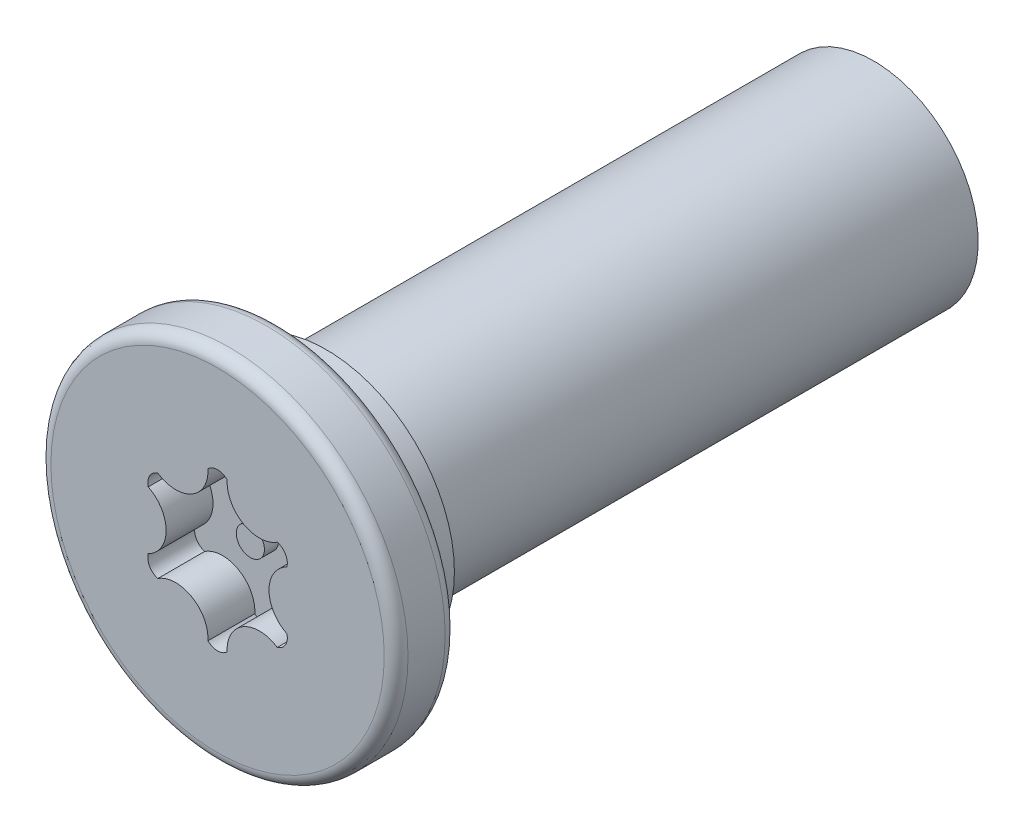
ISO-10303-21;
HEADER;
FILE_DESCRIPTION(('STEP AP214'),'2;1');
FILE_NAME('part.step','',(''),(''),'','','');
FILE_SCHEMA(('AUTOMOTIVE_DESIGN { 1 0 10303 214 1 1 1 1 }'));
ENDSEC;
DATA;
#1=APPLICATION_CONTEXT('core data for automotive mechanical design processes');
#2=APPLICATION_PROTOCOL_DEFINITION('international standard','automotive_design',2000,#1);
#3=PRODUCT_CONTEXT('',#1,'mechanical');
#4=PRODUCT('Part','Part','',(#3));
#5=PRODUCT_RELATED_PRODUCT_CATEGORY('part','',(#4));
#6=PRODUCT_DEFINITION_FORMATION('','',#4);
#7=PRODUCT_DEFINITION_CONTEXT('part definition',#1,'design');
#8=PRODUCT_DEFINITION('design','',#6,#7);
#9=PRODUCT_DEFINITION_SHAPE('','',#8);
#10=(LENGTH_UNIT() NAMED_UNIT(*) SI_UNIT(.MILLI.,.METRE.));
#11=(NAMED_UNIT(*) PLANE_ANGLE_UNIT() SI_UNIT($,.RADIAN.));
#12=(NAMED_UNIT(*) SI_UNIT($,.STERADIAN.) SOLID_ANGLE_UNIT());
#13=UNCERTAINTY_MEASURE_WITH_UNIT(LENGTH_MEASURE(1.E-05),#10,'distance_accuracy_value','');
#14=(GEOMETRIC_REPRESENTATION_CONTEXT(3) GLOBAL_UNCERTAINTY_ASSIGNED_CONTEXT((#13)) GLOBAL_UNIT_ASSIGNED_CONTEXT((#10,
#11,#12)) REPRESENTATION_CONTEXT('',''));
#15=CARTESIAN_POINT('',(0.,0.,0.));
#16=DIRECTION('',(0.,0.,1.));
#17=DIRECTION('',(1.,0.,0.));
#18=AXIS2_PLACEMENT_3D('',#15,#16,#17);
#19=CARTESIAN_POINT('',(0.,0.,0.));
#20=DIRECTION('',(0.,0.,1.));
#21=DIRECTION('',(1.,0.,0.));
#22=AXIS2_PLACEMENT_3D('',#19,#20,#21);
#23=PLANE('',#22);
#24=CARTESIAN_POINT('',(0.,0.,0.));
#25=DIRECTION('',(0.,0.,1.));
#26=DIRECTION('',(1.,0.,0.));
#27=AXIS2_PLACEMENT_3D('',#24,#25,#26);
#28=CIRCLE('',#27,3.55599999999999);
#29=CARTESIAN_POINT('',(3.55599999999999,0.,0.));
#30=VERTEX_POINT('',#29);
#31=EDGE_CURVE('E54',#30,#30,#28,.T.);
#32=ORIENTED_EDGE('',*,*,#31,.T.);
#33=EDGE_LOOP('',(#32));
#34=FACE_BOUND('',#33,.T.);
#35=CARTESIAN_POINT('',(0.893828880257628,1.54815703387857,0.));
#36=DIRECTION('',(0.,0.,1.));
#37=DIRECTION('',(1.,0.,0.));
#38=AXIS2_PLACEMENT_3D('',#35,#36,#37);
#39=CIRCLE('',#38,0.69);
#40=CARTESIAN_POINT('',(0.205060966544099,1.58937306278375,0.));
#41=VERTEX_POINT('',#40);
#42=CARTESIAN_POINT('',(1.27390696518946,0.972274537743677,0.));
#43=VERTEX_POINT('',#42);
#44=EDGE_CURVE('E181',#41,#43,#39,.T.);
#45=ORIENTED_EDGE('',*,*,#44,.T.);
#46=CARTESIAN_POINT('',(1.19884944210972,0.692156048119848,0.));
#47=DIRECTION('',(0.,0.,1.));
#48=DIRECTION('',(1.,0.,0.));
#49=AXIS2_PLACEMENT_3D('',#46,#47,#48);
#50=CIRCLE('',#49,0.29);
#51=CARTESIAN_POINT('',(1.47896793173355,0.617098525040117,0.));
#52=VERTEX_POINT('',#51);
#53=EDGE_CURVE('E61',#43,#52,#50,.F.);
#54=ORIENTED_EDGE('',*,*,#53,.T.);
#55=CARTESIAN_POINT('',(1.78765776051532,0.,0.));
#56=DIRECTION('',(0.,0.,1.));
#57=DIRECTION('',(1.,0.,0.));
#58=AXIS2_PLACEMENT_3D('',#55,#56,#57);
#59=CIRCLE('',#58,0.69);
#60=CARTESIAN_POINT('',(1.47896793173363,-0.617098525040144,0.));
#61=VERTEX_POINT('',#60);
#62=EDGE_CURVE('E111',#52,#61,#59,.T.);
#63=ORIENTED_EDGE('',*,*,#62,.T.);
#64=CARTESIAN_POINT('',(1.1988494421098,-0.692156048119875,0.));
#65=DIRECTION('',(0.,0.,1.));
#66=DIRECTION('',(1.,0.,0.));
#67=AXIS2_PLACEMENT_3D('',#64,#65,#66);
#68=CIRCLE('',#67,0.29);
#69=CARTESIAN_POINT('',(1.27390696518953,-0.972274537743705,0.));
#70=VERTEX_POINT('',#69);
#71=EDGE_CURVE('E216',#61,#70,#68,.F.);
#72=ORIENTED_EDGE('',*,*,#71,.T.);
#73=CARTESIAN_POINT('',(0.893828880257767,-1.54815703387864,0.));
#74=DIRECTION('',(0.,0.,1.));
#75=DIRECTION('',(1.,0.,0.));
#76=AXIS2_PLACEMENT_3D('',#73,#74,#75);
#77=CIRCLE('',#76,0.69);
#78=CARTESIAN_POINT('',(0.205060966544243,-1.5893730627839,0.));
#79=VERTEX_POINT('',#78);
#80=EDGE_CURVE('E160',#70,#79,#77,.T.);
#81=ORIENTED_EDGE('',*,*,#80,.T.);
#82=CARTESIAN_POINT('',(1.43067375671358E-13,-1.3843120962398,0.));
#83=DIRECTION('',(0.,0.,1.));
#84=DIRECTION('',(1.,0.,0.));
#85=AXIS2_PLACEMENT_3D('',#82,#83,#84);
#86=CIRCLE('',#85,0.29);
#87=CARTESIAN_POINT('',(-0.205060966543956,-1.5893730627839,0.));
#88=VERTEX_POINT('',#87);
#89=EDGE_CURVE('E210',#79,#88,#86,.F.);
#90=ORIENTED_EDGE('',*,*,#89,.T.);
#91=CARTESIAN_POINT('',(-0.893828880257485,-1.54815703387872,0.));
#92=DIRECTION('',(0.,0.,1.));
#93=DIRECTION('',(1.,0.,0.));
#94=AXIS2_PLACEMENT_3D('',#91,#92,#93);
#95=CIRCLE('',#94,0.69);
#96=CARTESIAN_POINT('',(-1.27390696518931,-0.97227453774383,0.));
#97=VERTEX_POINT('',#96);
#98=EDGE_CURVE('E206',#88,#97,#95,.T.);
#99=ORIENTED_EDGE('',*,*,#98,.T.);
#100=CARTESIAN_POINT('',(-1.19884944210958,-0.69215604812,0.));
#101=DIRECTION('',(0.,0.,1.));
#102=DIRECTION('',(1.,0.,0.));
#103=AXIS2_PLACEMENT_3D('',#100,#101,#102);
#104=CIRCLE('',#103,0.29);
#105=CARTESIAN_POINT('',(-1.47896793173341,-0.617098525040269,0.));
#106=VERTEX_POINT('',#105);
#107=EDGE_CURVE('E202',#97,#106,#104,.F.);
#108=ORIENTED_EDGE('',*,*,#107,.T.);
#109=CARTESIAN_POINT('',(-1.78765776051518,-1.56674837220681E-13,0.));
#110=DIRECTION('',(0.,0.,1.));
#111=DIRECTION('',(1.,0.,0.));
#112=AXIS2_PLACEMENT_3D('',#109,#110,#111);
#113=CIRCLE('',#112,0.69);
#114=CARTESIAN_POINT('',(-1.47896793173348,0.617098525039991,0.));
#115=VERTEX_POINT('',#114);
#116=EDGE_CURVE('E198',#106,#115,#113,.T.);
#117=ORIENTED_EDGE('',*,*,#116,.T.);
#118=CARTESIAN_POINT('',(-1.19884944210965,0.692156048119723,0.));
#119=DIRECTION('',(0.,0.,1.));
#120=DIRECTION('',(1.,0.,0.));
#121=AXIS2_PLACEMENT_3D('',#118,#119,#120);
#122=CIRCLE('',#121,0.29);
#123=CARTESIAN_POINT('',(-1.27390696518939,0.972274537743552,0.));
#124=VERTEX_POINT('',#123);
#125=EDGE_CURVE('E194',#115,#124,#122,.F.);
#126=ORIENTED_EDGE('',*,*,#125,.T.);
#127=CARTESIAN_POINT('',(-0.893828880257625,1.54815703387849,0.));
#128=DIRECTION('',(0.,0.,1.));
#129=DIRECTION('',(1.,0.,0.));
#130=AXIS2_PLACEMENT_3D('',#127,#128,#129);
#131=CIRCLE('',#130,0.690000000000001);
#132=CARTESIAN_POINT('',(-0.205060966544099,1.58937306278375,0.));
#133=VERTEX_POINT('',#132);
#134=EDGE_CURVE('E190',#124,#133,#131,.T.);
#135=ORIENTED_EDGE('',*,*,#134,.T.);
#136=CARTESIAN_POINT('',(0.,1.38431209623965,0.));
#137=DIRECTION('',(0.,0.,1.));
#138=DIRECTION('',(1.,0.,0.));
#139=AXIS2_PLACEMENT_3D('',#136,#137,#138);
#140=CIRCLE('',#139,0.29);
#141=EDGE_CURVE('E186',#133,#41,#140,.F.);
#142=ORIENTED_EDGE('',*,*,#141,.T.);
#143=EDGE_LOOP('',(#45,#54,#63,#72,#81,#90,#99,#108,#117,#126,#135,#142));
#144=FACE_BOUND('',#143,.T.);
#145=ADVANCED_FACE('F45',(#34,#144),#23,.T.);
#146=CARTESIAN_POINT('',(0.,0.,-1.3));
#147=DIRECTION('',(0.,0.,1.));
#148=DIRECTION('',(1.,0.,0.));
#149=AXIS2_PLACEMENT_3D('',#146,#147,#148);
#150=PLANE('',#149);
#151=CARTESIAN_POINT('',(0.,0.,-1.3));
#152=DIRECTION('',(0.,0.,1.));
#153=DIRECTION('',(1.,0.,0.));
#154=AXIS2_PLACEMENT_3D('',#151,#152,#153);
#155=CIRCLE('',#154,2.738000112);
#156=CARTESIAN_POINT('',(2.738000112,0.,-1.3));
#157=VERTEX_POINT('',#156);
#158=EDGE_CURVE('E11',#157,#157,#155,.F.);
#159=ORIENTED_EDGE('',*,*,#158,.F.);
#160=EDGE_LOOP('',(#159));
#161=FACE_BOUND('',#160,.T.);
#162=CARTESIAN_POINT('',(0.,0.,-1.3));
#163=DIRECTION('',(0.,0.,1.));
#164=DIRECTION('',(1.,0.,0.));
#165=AXIS2_PLACEMENT_3D('',#162,#163,#164);
#166=CIRCLE('',#165,3.55599999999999);
#167=CARTESIAN_POINT('',(3.55599999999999,0.,-1.3));
#168=VERTEX_POINT('',#167);
#169=EDGE_CURVE('E260',#168,#168,#166,.F.);
#170=ORIENTED_EDGE('',*,*,#169,.T.);
#171=EDGE_LOOP('',(#170));
#172=FACE_BOUND('',#171,.T.);
#173=ADVANCED_FACE('F283',(#161,#172),#150,.F.);
#174=CARTESIAN_POINT('',(0.,0.,-1.3));
#175=DIRECTION('',(0.,0.,1.));
#176=DIRECTION('',(1.,0.,0.));
#177=AXIS2_PLACEMENT_3D('',#174,#175,#176);
#178=CYLINDRICAL_SURFACE('',#177,3.80999999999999);
#179=CARTESIAN_POINT('',(0.,0.,-1.046));
#180=DIRECTION('',(0.,0.,1.));
#181=DIRECTION('',(1.,0.,0.));
#182=AXIS2_PLACEMENT_3D('',#179,#180,#181);
#183=CIRCLE('',#182,3.80999999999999);
#184=CARTESIAN_POINT('',(3.80999999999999,0.,-1.046));
#185=VERTEX_POINT('',#184);
#186=EDGE_CURVE('E256',#185,#185,#183,.T.);
#187=ORIENTED_EDGE('',*,*,#186,.T.);
#188=EDGE_LOOP('',(#187));
#189=FACE_BOUND('',#188,.T.);
#190=CARTESIAN_POINT('',(0.,0.,-0.254));
#191=DIRECTION('',(0.,0.,1.));
#192=DIRECTION('',(1.,0.,0.));
#193=AXIS2_PLACEMENT_3D('',#190,#191,#192);
#194=CIRCLE('',#193,3.80999999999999);
#195=CARTESIAN_POINT('',(3.80999999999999,0.,-0.254));
#196=VERTEX_POINT('',#195);
#197=EDGE_CURVE('E225',#196,#196,#194,.F.);
#198=ORIENTED_EDGE('',*,*,#197,.T.);
#199=EDGE_LOOP('',(#198));
#200=FACE_BOUND('',#199,.T.);
#201=ADVANCED_FACE('F289',(#189,#200),#178,.T.);
#202=CARTESIAN_POINT('',(1.19884944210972,0.692156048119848,-1.));
#203=DIRECTION('',(0.,0.,1.));
#204=DIRECTION('',(1.,0.,0.));
#205=AXIS2_PLACEMENT_3D('',#202,#203,#204);
#206=CYLINDRICAL_SURFACE('',#205,0.29);
#207=ORIENTED_EDGE('',*,*,#53,.F.);
#208=DIRECTION('',(0.,0.,1.));
#209=VECTOR('',#208,1.);
#210=CARTESIAN_POINT('',(1.27390696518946,0.972274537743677,-1.));
#211=LINE('',#210,#209);
#212=CARTESIAN_POINT('',(1.27390696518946,0.972274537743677,-1.));
#213=VERTEX_POINT('',#212);
#214=EDGE_CURVE('E178',#213,#43,#211,.T.);
#215=ORIENTED_EDGE('',*,*,#214,.F.);
#216=CARTESIAN_POINT('',(1.19884944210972,0.692156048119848,-1.));
#217=DIRECTION('',(0.,0.,1.));
#218=DIRECTION('',(1.,0.,0.));
#219=AXIS2_PLACEMENT_3D('',#216,#217,#218);
#220=CIRCLE('',#219,0.29);
#221=CARTESIAN_POINT('',(1.47896793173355,0.617098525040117,-1.));
#222=VERTEX_POINT('',#221);
#223=EDGE_CURVE('E221',#213,#222,#220,.F.);
#224=ORIENTED_EDGE('',*,*,#223,.T.);
#225=DIRECTION('',(0.,0.,1.));
#226=VECTOR('',#225,1.);
#227=CARTESIAN_POINT('',(1.47896793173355,0.617098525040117,-1.));
#228=LINE('',#227,#226);
#229=EDGE_CURVE('E222',#222,#52,#228,.T.);
#230=ORIENTED_EDGE('',*,*,#229,.T.);
#231=EDGE_LOOP('',(#207,#215,#224,#230));
#232=FACE_BOUND('',#231,.T.);
#233=ADVANCED_FACE('F294',(#232),#206,.F.);
#234=CARTESIAN_POINT('',(1.78765776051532,0.,-1.));
#235=DIRECTION('',(0.,0.,1.));
#236=DIRECTION('',(1.,0.,0.));
#237=AXIS2_PLACEMENT_3D('',#234,#235,#236);
#238=CYLINDRICAL_SURFACE('',#237,0.69);
#239=ORIENTED_EDGE('',*,*,#62,.F.);
#240=ORIENTED_EDGE('',*,*,#229,.F.);
#241=CARTESIAN_POINT('',(1.78765776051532,0.,-1.));
#242=DIRECTION('',(0.,0.,1.));
#243=DIRECTION('',(1.,0.,0.));
#244=AXIS2_PLACEMENT_3D('',#241,#242,#243);
#245=CIRCLE('',#244,0.69);
#246=CARTESIAN_POINT('',(1.47896793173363,-0.617098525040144,-1.));
#247=VERTEX_POINT('',#246);
#248=EDGE_CURVE('E70',#222,#247,#245,.T.);
#249=ORIENTED_EDGE('',*,*,#248,.T.);
#250=DIRECTION('',(0.,0.,1.));
#251=VECTOR('',#250,1.);
#252=CARTESIAN_POINT('',(1.47896793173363,-0.617098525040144,-1.));
#253=LINE('',#252,#251);
#254=EDGE_CURVE('E151',#247,#61,#253,.T.);
#255=ORIENTED_EDGE('',*,*,#254,.T.);
#256=EDGE_LOOP('',(#239,#240,#249,#255));
#257=FACE_BOUND('',#256,.T.);
#258=ADVANCED_FACE('F301',(#257),#238,.T.);
#259=CARTESIAN_POINT('',(1.1988494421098,-0.692156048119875,-1.));
#260=DIRECTION('',(0.,0.,1.));
#261=DIRECTION('',(1.,0.,0.));
#262=AXIS2_PLACEMENT_3D('',#259,#260,#261);
#263=CYLINDRICAL_SURFACE('',#262,0.29);
#264=ORIENTED_EDGE('',*,*,#71,.F.);
#265=ORIENTED_EDGE('',*,*,#254,.F.);
#266=CARTESIAN_POINT('',(1.1988494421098,-0.692156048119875,-1.));
#267=DIRECTION('',(0.,0.,1.));
#268=DIRECTION('',(1.,0.,0.));
#269=AXIS2_PLACEMENT_3D('',#266,#267,#268);
#270=CIRCLE('',#269,0.29);
#271=CARTESIAN_POINT('',(1.27390696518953,-0.972274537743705,-1.));
#272=VERTEX_POINT('',#271);
#273=EDGE_CURVE('E145',#247,#272,#270,.F.);
#274=ORIENTED_EDGE('',*,*,#273,.T.);
#275=DIRECTION('',(0.,0.,1.));
#276=VECTOR('',#275,1.);
#277=CARTESIAN_POINT('',(1.27390696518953,-0.972274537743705,-1.));
#278=LINE('',#277,#276);
#279=EDGE_CURVE('E149',#272,#70,#278,.T.);
#280=ORIENTED_EDGE('',*,*,#279,.T.);
#281=EDGE_LOOP('',(#264,#265,#274,#280));
#282=FACE_BOUND('',#281,.T.);
#283=ADVANCED_FACE('F148',(#282),#263,.F.);
#284=CARTESIAN_POINT('',(0.893828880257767,-1.54815703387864,-1.));
#285=DIRECTION('',(0.,0.,1.));
#286=DIRECTION('',(1.,0.,0.));
#287=AXIS2_PLACEMENT_3D('',#284,#285,#286);
#288=CYLINDRICAL_SURFACE('',#287,0.69);
#289=ORIENTED_EDGE('',*,*,#80,.F.);
#290=ORIENTED_EDGE('',*,*,#279,.F.);
#291=CARTESIAN_POINT('',(0.893828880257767,-1.54815703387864,-1.));
#292=DIRECTION('',(0.,0.,1.));
#293=DIRECTION('',(1.,0.,0.));
#294=AXIS2_PLACEMENT_3D('',#291,#292,#293);
#295=CIRCLE('',#294,0.69);
#296=CARTESIAN_POINT('',(0.205060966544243,-1.5893730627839,-1.));
#297=VERTEX_POINT('',#296);
#298=EDGE_CURVE('E154',#272,#297,#295,.T.);
#299=ORIENTED_EDGE('',*,*,#298,.T.);
#300=DIRECTION('',(0.,0.,1.));
#301=VECTOR('',#300,1.);
#302=CARTESIAN_POINT('',(0.205060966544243,-1.5893730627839,-1.));
#303=LINE('',#302,#301);
#304=EDGE_CURVE('E163',#297,#79,#303,.T.);
#305=ORIENTED_EDGE('',*,*,#304,.T.);
#306=EDGE_LOOP('',(#289,#290,#299,#305));
#307=FACE_BOUND('',#306,.T.);
#308=ADVANCED_FACE('F157',(#307),#288,.T.);
#309=CARTESIAN_POINT('',(1.43067375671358E-13,-1.3843120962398,-1.));
#310=DIRECTION('',(0.,0.,1.));
#311=DIRECTION('',(1.,0.,0.));
#312=AXIS2_PLACEMENT_3D('',#309,#310,#311);
#313=CYLINDRICAL_SURFACE('',#312,0.29);
#314=ORIENTED_EDGE('',*,*,#89,.F.);
#315=ORIENTED_EDGE('',*,*,#304,.F.);
#316=CARTESIAN_POINT('',(1.43067375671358E-13,-1.3843120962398,-1.));
#317=DIRECTION('',(0.,0.,1.));
#318=DIRECTION('',(1.,0.,0.));
#319=AXIS2_PLACEMENT_3D('',#316,#317,#318);
#320=CIRCLE('',#319,0.29);
#321=CARTESIAN_POINT('',(-0.205060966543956,-1.5893730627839,-1.));
#322=VERTEX_POINT('',#321);
#323=EDGE_CURVE('E168',#297,#322,#320,.F.);
#324=ORIENTED_EDGE('',*,*,#323,.T.);
#325=DIRECTION('',(0.,0.,1.));
#326=VECTOR('',#325,1.);
#327=CARTESIAN_POINT('',(-0.205060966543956,-1.5893730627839,-1.));
#328=LINE('',#327,#326);
#329=EDGE_CURVE('E230',#322,#88,#328,.T.);
#330=ORIENTED_EDGE('',*,*,#329,.T.);
#331=EDGE_LOOP('',(#314,#315,#324,#330));
#332=FACE_BOUND('',#331,.T.);
#333=ADVANCED_FACE('F318',(#332),#313,.F.);
#334=CARTESIAN_POINT('',(-0.893828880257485,-1.54815703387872,-1.));
#335=DIRECTION('',(0.,0.,1.));
#336=DIRECTION('',(1.,0.,0.));
#337=AXIS2_PLACEMENT_3D('',#334,#335,#336);
#338=CYLINDRICAL_SURFACE('',#337,0.69);
#339=ORIENTED_EDGE('',*,*,#98,.F.);
#340=ORIENTED_EDGE('',*,*,#329,.F.);
#341=CARTESIAN_POINT('',(-0.893828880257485,-1.54815703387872,-1.));
#342=DIRECTION('',(0.,0.,1.));
#343=DIRECTION('',(1.,0.,0.));
#344=AXIS2_PLACEMENT_3D('',#341,#342,#343);
#345=CIRCLE('',#344,0.69);
#346=CARTESIAN_POINT('',(-1.27390696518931,-0.97227453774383,-1.));
#347=VERTEX_POINT('',#346);
#348=EDGE_CURVE('E172',#322,#347,#345,.T.);
#349=ORIENTED_EDGE('',*,*,#348,.T.);
#350=DIRECTION('',(0.,0.,1.));
#351=VECTOR('',#350,1.);
#352=CARTESIAN_POINT('',(-1.27390696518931,-0.97227453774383,-1.));
#353=LINE('',#352,#351);
#354=EDGE_CURVE('E233',#347,#97,#353,.T.);
#355=ORIENTED_EDGE('',*,*,#354,.T.);
#356=EDGE_LOOP('',(#339,#340,#349,#355));
#357=FACE_BOUND('',#356,.T.);
#358=ADVANCED_FACE('F321',(#357),#338,.T.);
#359=CARTESIAN_POINT('',(-1.19884944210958,-0.69215604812,-1.));
#360=DIRECTION('',(0.,0.,1.));
#361=DIRECTION('',(1.,0.,0.));
#362=AXIS2_PLACEMENT_3D('',#359,#360,#361);
#363=CYLINDRICAL_SURFACE('',#362,0.29);
#364=ORIENTED_EDGE('',*,*,#107,.F.);
#365=ORIENTED_EDGE('',*,*,#354,.F.);
#366=CARTESIAN_POINT('',(-1.19884944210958,-0.69215604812,-1.));
#367=DIRECTION('',(0.,0.,1.));
#368=DIRECTION('',(1.,0.,0.));
#369=AXIS2_PLACEMENT_3D('',#366,#367,#368);
#370=CIRCLE('',#369,0.29);
#371=CARTESIAN_POINT('',(-1.47896793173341,-0.617098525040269,-1.));
#372=VERTEX_POINT('',#371);
#373=EDGE_CURVE('E374',#347,#372,#370,.F.);
#374=ORIENTED_EDGE('',*,*,#373,.T.);
#375=DIRECTION('',(0.,0.,1.));
#376=VECTOR('',#375,1.);
#377=CARTESIAN_POINT('',(-1.47896793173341,-0.617098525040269,-1.));
#378=LINE('',#377,#376);
#379=EDGE_CURVE('E236',#372,#106,#378,.T.);
#380=ORIENTED_EDGE('',*,*,#379,.T.);
#381=EDGE_LOOP('',(#364,#365,#374,#380));
#382=FACE_BOUND('',#381,.T.);
#383=ADVANCED_FACE('F325',(#382),#363,.F.);
#384=CARTESIAN_POINT('',(-1.78765776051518,-1.56674837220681E-13,-1.));
#385=DIRECTION('',(0.,0.,1.));
#386=DIRECTION('',(1.,0.,0.));
#387=AXIS2_PLACEMENT_3D('',#384,#385,#386);
#388=CYLINDRICAL_SURFACE('',#387,0.69);
#389=ORIENTED_EDGE('',*,*,#116,.F.);
#390=ORIENTED_EDGE('',*,*,#379,.F.);
#391=CARTESIAN_POINT('',(-1.78765776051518,-1.56674837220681E-13,-1.));
#392=DIRECTION('',(0.,0.,1.));
#393=DIRECTION('',(1.,0.,0.));
#394=AXIS2_PLACEMENT_3D('',#391,#392,#393);
#395=CIRCLE('',#394,0.69);
#396=CARTESIAN_POINT('',(-1.47896793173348,0.617098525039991,-1.));
#397=VERTEX_POINT('',#396);
#398=EDGE_CURVE('E371',#372,#397,#395,.T.);
#399=ORIENTED_EDGE('',*,*,#398,.T.);
#400=DIRECTION('',(0.,0.,1.));
#401=VECTOR('',#400,1.);
#402=CARTESIAN_POINT('',(-1.47896793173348,0.617098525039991,-1.));
#403=LINE('',#402,#401);
#404=EDGE_CURVE('E239',#397,#115,#403,.T.);
#405=ORIENTED_EDGE('',*,*,#404,.T.);
#406=EDGE_LOOP('',(#389,#390,#399,#405));
#407=FACE_BOUND('',#406,.T.);
#408=ADVANCED_FACE('F329',(#407),#388,.T.);
#409=CARTESIAN_POINT('',(-1.19884944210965,0.692156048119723,-1.));
#410=DIRECTION('',(0.,0.,1.));
#411=DIRECTION('',(1.,0.,0.));
#412=AXIS2_PLACEMENT_3D('',#409,#410,#411);
#413=CYLINDRICAL_SURFACE('',#412,0.29);
#414=ORIENTED_EDGE('',*,*,#125,.F.);
#415=ORIENTED_EDGE('',*,*,#404,.F.);
#416=CARTESIAN_POINT('',(-1.19884944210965,0.692156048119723,-1.));
#417=DIRECTION('',(0.,0.,1.));
#418=DIRECTION('',(1.,0.,0.));
#419=AXIS2_PLACEMENT_3D('',#416,#417,#418);
#420=CIRCLE('',#419,0.29);
#421=CARTESIAN_POINT('',(-1.27390696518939,0.972274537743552,-1.));
#422=VERTEX_POINT('',#421);
#423=EDGE_CURVE('E364',#397,#422,#420,.F.);
#424=ORIENTED_EDGE('',*,*,#423,.T.);
#425=DIRECTION('',(0.,0.,1.));
#426=VECTOR('',#425,1.);
#427=CARTESIAN_POINT('',(-1.27390696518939,0.972274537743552,-1.));
#428=LINE('',#427,#426);
#429=EDGE_CURVE('E242',#422,#124,#428,.T.);
#430=ORIENTED_EDGE('',*,*,#429,.T.);
#431=EDGE_LOOP('',(#414,#415,#424,#430));
#432=FACE_BOUND('',#431,.T.);
#433=ADVANCED_FACE('F333',(#432),#413,.F.);
#434=CARTESIAN_POINT('',(-0.893828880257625,1.54815703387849,-1.));
#435=DIRECTION('',(0.,0.,1.));
#436=DIRECTION('',(1.,0.,0.));
#437=AXIS2_PLACEMENT_3D('',#434,#435,#436);
#438=CYLINDRICAL_SURFACE('',#437,0.690000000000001);
#439=ORIENTED_EDGE('',*,*,#134,.F.);
#440=ORIENTED_EDGE('',*,*,#429,.F.);
#441=CARTESIAN_POINT('',(-0.893828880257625,1.54815703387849,-1.));
#442=DIRECTION('',(0.,0.,1.));
#443=DIRECTION('',(1.,0.,0.));
#444=AXIS2_PLACEMENT_3D('',#441,#442,#443);
#445=CIRCLE('',#444,0.690000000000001);
#446=CARTESIAN_POINT('',(-0.205060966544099,1.58937306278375,-1.));
#447=VERTEX_POINT('',#446);
#448=EDGE_CURVE('E360',#422,#447,#445,.T.);
#449=ORIENTED_EDGE('',*,*,#448,.T.);
#450=DIRECTION('',(0.,0.,1.));
#451=VECTOR('',#450,1.);
#452=CARTESIAN_POINT('',(-0.205060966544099,1.58937306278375,-1.));
#453=LINE('',#452,#451);
#454=EDGE_CURVE('E245',#447,#133,#453,.T.);
#455=ORIENTED_EDGE('',*,*,#454,.T.);
#456=EDGE_LOOP('',(#439,#440,#449,#455));
#457=FACE_BOUND('',#456,.T.);
#458=ADVANCED_FACE('F337',(#457),#438,.T.);
#459=CARTESIAN_POINT('',(0.,1.38431209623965,-1.));
#460=DIRECTION('',(0.,0.,1.));
#461=DIRECTION('',(1.,0.,0.));
#462=AXIS2_PLACEMENT_3D('',#459,#460,#461);
#463=CYLINDRICAL_SURFACE('',#462,0.29);
#464=ORIENTED_EDGE('',*,*,#141,.F.);
#465=ORIENTED_EDGE('',*,*,#454,.F.);
#466=CARTESIAN_POINT('',(0.,1.38431209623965,-1.));
#467=DIRECTION('',(0.,0.,1.));
#468=DIRECTION('',(1.,0.,0.));
#469=AXIS2_PLACEMENT_3D('',#466,#467,#468);
#470=CIRCLE('',#469,0.29);
#471=CARTESIAN_POINT('',(0.205060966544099,1.58937306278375,-1.));
#472=VERTEX_POINT('',#471);
#473=EDGE_CURVE('E357',#447,#472,#470,.F.);
#474=ORIENTED_EDGE('',*,*,#473,.T.);
#475=DIRECTION('',(0.,0.,1.));
#476=VECTOR('',#475,1.);
#477=CARTESIAN_POINT('',(0.205060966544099,1.58937306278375,-1.));
#478=LINE('',#477,#476);
#479=EDGE_CURVE('E248',#472,#41,#478,.T.);
#480=ORIENTED_EDGE('',*,*,#479,.T.);
#481=EDGE_LOOP('',(#464,#465,#474,#480));
#482=FACE_BOUND('',#481,.T.);
#483=ADVANCED_FACE('F341',(#482),#463,.F.);
#484=CARTESIAN_POINT('',(0.893828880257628,1.54815703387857,-1.));
#485=DIRECTION('',(0.,0.,1.));
#486=DIRECTION('',(1.,0.,0.));
#487=AXIS2_PLACEMENT_3D('',#484,#485,#486);
#488=CYLINDRICAL_SURFACE('',#487,0.69);
#489=ORIENTED_EDGE('',*,*,#44,.F.);
#490=ORIENTED_EDGE('',*,*,#479,.F.);
#491=CARTESIAN_POINT('',(0.893828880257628,1.54815703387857,-1.));
#492=DIRECTION('',(0.,0.,1.));
#493=DIRECTION('',(1.,0.,0.));
#494=AXIS2_PLACEMENT_3D('',#491,#492,#493);
#495=CIRCLE('',#494,0.69);
#496=EDGE_CURVE('E118',#472,#213,#495,.T.);
#497=ORIENTED_EDGE('',*,*,#496,.T.);
#498=ORIENTED_EDGE('',*,*,#214,.T.);
#499=EDGE_LOOP('',(#489,#490,#497,#498));
#500=FACE_BOUND('',#499,.T.);
#501=ADVANCED_FACE('F344',(#500),#488,.T.);
#502=CARTESIAN_POINT('',(0.,0.,-1.));
#503=DIRECTION('',(0.,0.,1.));
#504=DIRECTION('',(1.,0.,0.));
#505=AXIS2_PLACEMENT_3D('',#502,#503,#504);
#506=PLANE('',#505);
#507=CARTESIAN_POINT('',(0.,0.,-1.));
#508=DIRECTION('',(0.,0.,1.));
#509=DIRECTION('',(1.,0.,0.));
#510=AXIS2_PLACEMENT_3D('',#507,#508,#509);
#511=CIRCLE('',#510,0.3);
#512=CARTESIAN_POINT('',(0.3,0.,-1.));
#513=VERTEX_POINT('',#512);
#514=EDGE_CURVE('E396',#513,#513,#511,.T.);
#515=ORIENTED_EDGE('',*,*,#514,.F.);
#516=EDGE_LOOP('',(#515));
#517=FACE_BOUND('',#516,.T.);
#518=ORIENTED_EDGE('',*,*,#223,.F.);
#519=ORIENTED_EDGE('',*,*,#496,.F.);
#520=ORIENTED_EDGE('',*,*,#473,.F.);
#521=ORIENTED_EDGE('',*,*,#448,.F.);
#522=ORIENTED_EDGE('',*,*,#423,.F.);
#523=ORIENTED_EDGE('',*,*,#398,.F.);
#524=ORIENTED_EDGE('',*,*,#373,.F.);
#525=ORIENTED_EDGE('',*,*,#348,.F.);
#526=ORIENTED_EDGE('',*,*,#323,.F.);
#527=ORIENTED_EDGE('',*,*,#298,.F.);
#528=ORIENTED_EDGE('',*,*,#273,.F.);
#529=ORIENTED_EDGE('',*,*,#248,.F.);
#530=EDGE_LOOP('',(#518,#519,#520,#521,#522,#523,#524,#525,#526,#527,#528,#529));
#531=FACE_BOUND('',#530,.T.);
#532=ADVANCED_FACE('F166',(#517,#531),#506,.T.);
#533=CARTESIAN_POINT('',(0.,0.,-1.046));
#534=DIRECTION('',(0.,0.,1.));
#535=DIRECTION('',(1.,0.,0.));
#536=AXIS2_PLACEMENT_3D('',#533,#534,#535);
#537=TOROIDAL_SURFACE('',#536,3.55599999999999,0.254);
#538=ORIENTED_EDGE('',*,*,#169,.F.);
#539=EDGE_LOOP('',(#538));
#540=FACE_BOUND('',#539,.T.);
#541=ORIENTED_EDGE('',*,*,#186,.F.);
#542=EDGE_LOOP('',(#541));
#543=FACE_BOUND('',#542,.T.);
#544=ADVANCED_FACE('F271',(#540,#543),#537,.T.);
#545=CARTESIAN_POINT('',(0.,0.,-0.254));
#546=DIRECTION('',(0.,0.,1.));
#547=DIRECTION('',(1.,0.,0.));
#548=AXIS2_PLACEMENT_3D('',#545,#546,#547);
#549=TOROIDAL_SURFACE('',#548,3.55599999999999,0.254);
#550=ORIENTED_EDGE('',*,*,#197,.F.);
#551=EDGE_LOOP('',(#550));
#552=FACE_BOUND('',#551,.T.);
#553=ORIENTED_EDGE('',*,*,#31,.F.);
#554=EDGE_LOOP('',(#553));
#555=FACE_BOUND('',#554,.T.);
#556=ADVANCED_FACE('F47',(#552,#555),#549,.T.);
#557=CARTESIAN_POINT('',(0.,0.,-2.316));
#558=DIRECTION('',(0.,0.,-1.));
#559=DIRECTION('',(-1.,0.,0.));
#560=AXIS2_PLACEMENT_3D('',#557,#558,#559);
#561=PLANE('',#560);
#562=CARTESIAN_POINT('',(0.,0.,-2.316));
#563=DIRECTION('',(0.,0.,-1.));
#564=DIRECTION('',(-1.,0.,0.));
#565=AXIS2_PLACEMENT_3D('',#562,#563,#564);
#566=CIRCLE('',#565,2.738000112);
#567=CARTESIAN_POINT('',(-2.738000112,0.,-2.316));
#568=VERTEX_POINT('',#567);
#569=EDGE_CURVE('E182',#568,#568,#566,.T.);
#570=ORIENTED_EDGE('',*,*,#569,.T.);
#571=EDGE_LOOP('',(#570));
#572=FACE_BOUND('',#571,.T.);
#573=CARTESIAN_POINT('',(0.,0.,-2.316));
#574=DIRECTION('',(0.,0.,-1.));
#575=DIRECTION('',(-1.,0.,0.));
#576=AXIS2_PLACEMENT_3D('',#573,#574,#575);
#577=CIRCLE('',#576,2.230000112);
#578=CARTESIAN_POINT('',(-2.230000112,0.,-2.316));
#579=VERTEX_POINT('',#578);
#580=EDGE_CURVE('E400',#579,#579,#577,.T.);
#581=ORIENTED_EDGE('',*,*,#580,.F.);
#582=EDGE_LOOP('',(#581));
#583=FACE_BOUND('',#582,.T.);
#584=ADVANCED_FACE('F270',(#572,#583),#561,.T.);
#585=CARTESIAN_POINT('',(0.,0.,-2.316));
#586=DIRECTION('',(0.,0.,1.));
#587=DIRECTION('',(1.,0.,0.));
#588=AXIS2_PLACEMENT_3D('',#585,#586,#587);
#589=CYLINDRICAL_SURFACE('',#588,2.738000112);
#590=ORIENTED_EDGE('',*,*,#569,.F.);
#591=EDGE_LOOP('',(#590));
#592=FACE_BOUND('',#591,.T.);
#593=ORIENTED_EDGE('',*,*,#158,.T.);
#594=EDGE_LOOP('',(#593));
#595=FACE_BOUND('',#594,.T.);
#596=ADVANCED_FACE('F277',(#592,#595),#589,.T.);
#597=CARTESIAN_POINT('',(0.,0.,-0.7));
#598=DIRECTION('',(0.,0.,-1.));
#599=DIRECTION('',(-1.,0.,0.));
#600=AXIS2_PLACEMENT_3D('',#597,#598,#599);
#601=CYLINDRICAL_SURFACE('',#600,0.3);
#602=CARTESIAN_POINT('',(0.,0.,-0.7));
#603=DIRECTION('',(0.,0.,1.));
#604=DIRECTION('',(1.,0.,0.));
#605=AXIS2_PLACEMENT_3D('',#602,#603,#604);
#606=CIRCLE('',#605,0.3);
#607=CARTESIAN_POINT('',(0.3,0.,-0.7));
#608=VERTEX_POINT('',#607);
#609=EDGE_CURVE('E395',#608,#608,#606,.T.);
#610=ORIENTED_EDGE('',*,*,#609,.F.);
#611=EDGE_LOOP('',(#610));
#612=FACE_BOUND('',#611,.T.);
#613=ORIENTED_EDGE('',*,*,#514,.T.);
#614=EDGE_LOOP('',(#613));
#615=FACE_BOUND('',#614,.T.);
#616=ADVANCED_FACE('F424',(#612,#615),#601,.T.);
#617=CARTESIAN_POINT('',(0.,0.,-0.7));
#618=DIRECTION('',(0.,0.,1.));
#619=DIRECTION('',(1.,0.,0.));
#620=AXIS2_PLACEMENT_3D('',#617,#618,#619);
#621=PLANE('',#620);
#622=ORIENTED_EDGE('',*,*,#609,.T.);
#623=EDGE_LOOP('',(#622));
#624=FACE_BOUND('',#623,.T.);
#625=ADVANCED_FACE('F416',(#624),#621,.T.);
#626=CARTESIAN_POINT('',(0.,0.,-14.));
#627=DIRECTION('',(0.,0.,1.));
#628=DIRECTION('',(1.,0.,0.));
#629=AXIS2_PLACEMENT_3D('',#626,#627,#628);
#630=CYLINDRICAL_SURFACE('',#629,2.230000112);
#631=ORIENTED_EDGE('',*,*,#580,.T.);
#632=EDGE_LOOP('',(#631));
#633=FACE_BOUND('',#632,.T.);
#634=CARTESIAN_POINT('',(0.,0.,-14.));
#635=DIRECTION('',(0.,0.,-1.));
#636=DIRECTION('',(-1.,0.,0.));
#637=AXIS2_PLACEMENT_3D('',#634,#635,#636);
#638=CIRCLE('',#637,2.230000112);
#639=CARTESIAN_POINT('',(-2.230000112,0.,-14.));
#640=VERTEX_POINT('',#639);
#641=EDGE_CURVE('E407',#640,#640,#638,.T.);
#642=ORIENTED_EDGE('',*,*,#641,.F.);
#643=EDGE_LOOP('',(#642));
#644=FACE_BOUND('',#643,.T.);
#645=ADVANCED_FACE('F414',(#633,#644),#630,.T.);
#646=CARTESIAN_POINT('',(0.,0.,-14.));
#647=DIRECTION('',(0.,0.,-1.));
#648=DIRECTION('',(-1.,0.,0.));
#649=AXIS2_PLACEMENT_3D('',#646,#647,#648);
#650=PLANE('',#649);
#651=ORIENTED_EDGE('',*,*,#641,.T.);
#652=EDGE_LOOP('',(#651));
#653=FACE_BOUND('',#652,.T.);
#654=ADVANCED_FACE('F412',(#653),#650,.T.);
#655=CLOSED_SHELL('',(#145,#173,#201,#233,#258,#283,#308,#333,#358,#383,#408,#433,#458,#483,
#501,#532,#544,#556,#584,#596,#616,#625,#645,#654));
#656=MANIFOLD_SOLID_BREP('B2',#655);
#657=ADVANCED_BREP_SHAPE_REPRESENTATION('',(#18,#656),#14);
#658=SHAPE_DEFINITION_REPRESENTATION(#9,#657);
ENDSEC;
END-ISO-10303-21;
